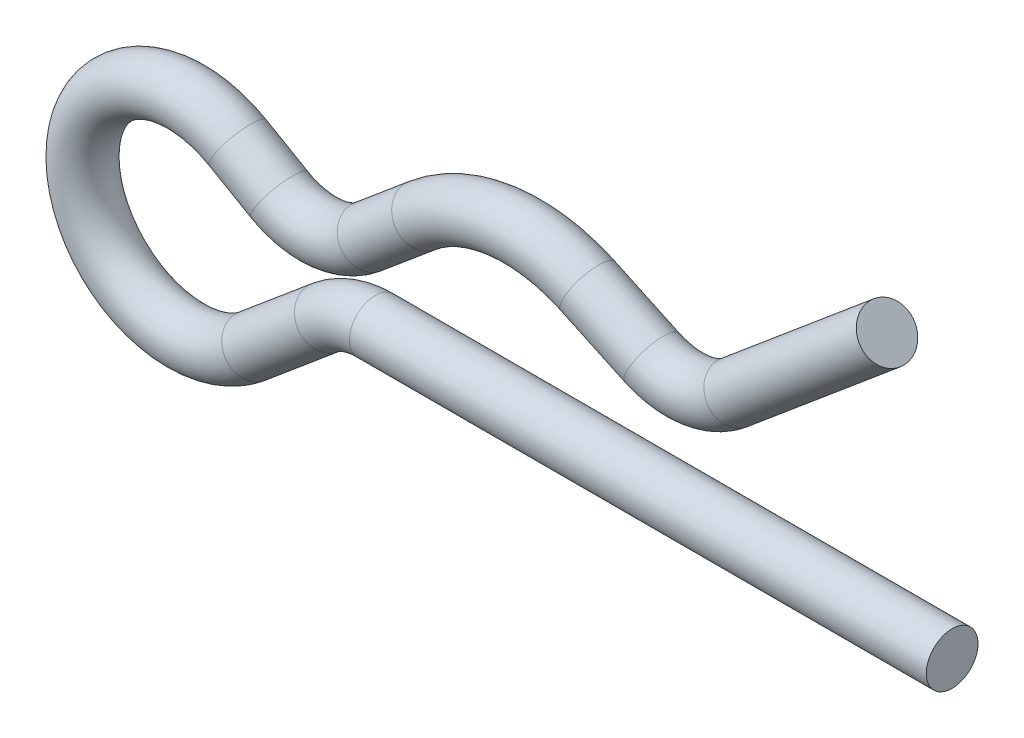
ISO-10303-21;
HEADER;
FILE_DESCRIPTION(('STEP AP214'),'2;1');
FILE_NAME('part.step','',(''),(''),'','','');
FILE_SCHEMA(('AUTOMOTIVE_DESIGN { 1 0 10303 214 1 1 1 1 }'));
ENDSEC;
DATA;
#1=APPLICATION_CONTEXT('core data for automotive mechanical design processes');
#2=APPLICATION_PROTOCOL_DEFINITION('international standard','automotive_design',2000,#1);
#3=PRODUCT_CONTEXT('',#1,'mechanical');
#4=PRODUCT('Part','Part','',(#3));
#5=PRODUCT_RELATED_PRODUCT_CATEGORY('part','',(#4));
#6=PRODUCT_DEFINITION_FORMATION('','',#4);
#7=PRODUCT_DEFINITION_CONTEXT('part definition',#1,'design');
#8=PRODUCT_DEFINITION('design','',#6,#7);
#9=PRODUCT_DEFINITION_SHAPE('','',#8);
#10=(LENGTH_UNIT() NAMED_UNIT(*) SI_UNIT(.MILLI.,.METRE.));
#11=(NAMED_UNIT(*) PLANE_ANGLE_UNIT() SI_UNIT($,.RADIAN.));
#12=(NAMED_UNIT(*) SI_UNIT($,.STERADIAN.) SOLID_ANGLE_UNIT());
#13=UNCERTAINTY_MEASURE_WITH_UNIT(LENGTH_MEASURE(1.E-05),#10,'distance_accuracy_value','');
#14=(GEOMETRIC_REPRESENTATION_CONTEXT(3) GLOBAL_UNCERTAINTY_ASSIGNED_CONTEXT((#13)) GLOBAL_UNIT_ASSIGNED_CONTEXT((#10,
#11,#12)) REPRESENTATION_CONTEXT('',''));
#15=CARTESIAN_POINT('',(0.,0.,0.));
#16=DIRECTION('',(0.,0.,1.));
#17=DIRECTION('',(1.,0.,0.));
#18=AXIS2_PLACEMENT_3D('',#15,#16,#17);
#19=CARTESIAN_POINT('',(10.7715398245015,8.33124333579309,0.));
#20=DIRECTION('',(-0.766044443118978,-0.642787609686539,0.));
#21=DIRECTION('',(-0.642787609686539,0.766044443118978,0.));
#22=AXIS2_PLACEMENT_3D('',#19,#20,#21);
#23=PLANE('',#22);
#24=CARTESIAN_POINT('',(11.2857699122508,7.71840778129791,0.));
#25=DIRECTION('',(0.766044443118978,0.642787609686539,0.));
#26=DIRECTION('',(-0.642787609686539,0.766044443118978,0.));
#27=AXIS2_PLACEMENT_3D('',#24,#25,#26);
#28=CIRCLE('',#27,0.8);
#29=CARTESIAN_POINT('',(11.8,7.10557222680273,0.));
#30=VERTEX_POINT('',#29);
#31=EDGE_CURVE('E11',#30,#30,#28,.T.);
#32=ORIENTED_EDGE('',*,*,#31,.T.);
#33=EDGE_LOOP('',(#32));
#34=FACE_BOUND('',#33,.T.);
#35=ADVANCED_FACE('F19',(#34),#23,.F.);
#36=CARTESIAN_POINT('',(13.3,0.,0.));
#37=DIRECTION('',(-1.,0.,0.));
#38=DIRECTION('',(0.,0.,1.));
#39=AXIS2_PLACEMENT_3D('',#36,#37,#38);
#40=PLANE('',#39);
#41=CARTESIAN_POINT('',(13.3,0.,0.));
#42=DIRECTION('',(-1.,0.,0.));
#43=DIRECTION('',(0.,0.,1.));
#44=AXIS2_PLACEMENT_3D('',#41,#42,#43);
#45=CIRCLE('',#44,0.8);
#46=CARTESIAN_POINT('',(13.3,0.,-0.8));
#47=VERTEX_POINT('',#46);
#48=EDGE_CURVE('E30',#47,#47,#45,.T.);
#49=ORIENTED_EDGE('',*,*,#48,.F.);
#50=EDGE_LOOP('',(#49));
#51=FACE_BOUND('',#50,.T.);
#52=ADVANCED_FACE('F144',(#51),#40,.F.);
#53=CARTESIAN_POINT('',(11.2857699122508,7.71840778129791,0.));
#54=DIRECTION('',(0.766044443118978,0.642787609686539,0.));
#55=DIRECTION('',(-0.642787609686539,0.766044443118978,0.));
#56=AXIS2_PLACEMENT_3D('',#53,#54,#55);
#57=CYLINDRICAL_SURFACE('',#56,0.8);
#58=ORIENTED_EDGE('',*,*,#31,.F.);
#59=EDGE_LOOP('',(#58));
#60=FACE_BOUND('',#59,.T.);
#61=CARTESIAN_POINT('',(6.57010290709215,3.76149333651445,0.));
#62=DIRECTION('',(0.766044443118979,0.642787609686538,0.));
#63=DIRECTION('',(-0.642787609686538,0.766044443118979,0.));
#64=AXIS2_PLACEMENT_3D('',#61,#62,#63);
#65=CIRCLE('',#64,0.8);
#66=CARTESIAN_POINT('',(6.05587281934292,4.37432889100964,0.));
#67=VERTEX_POINT('',#66);
#68=EDGE_CURVE('E85',#67,#67,#65,.T.);
#69=ORIENTED_EDGE('',*,*,#68,.T.);
#70=EDGE_LOOP('',(#69));
#71=FACE_BOUND('',#70,.T.);
#72=ADVANCED_FACE('F149',(#60,#71),#57,.T.);
#73=CARTESIAN_POINT('',(4.01312881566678,3.42486131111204,0.));
#74=DIRECTION('',(0.90630778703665,-0.4226182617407,0.));
#75=DIRECTION('',(0.4226182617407,0.90630778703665,0.));
#76=AXIS2_PLACEMENT_3D('',#73,#74,#75);
#77=CYLINDRICAL_SURFACE('',#76,0.8);
#78=CARTESIAN_POINT('',(4.01312881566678,3.42486131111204,0.));
#79=DIRECTION('',(0.90630778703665,-0.4226182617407,0.));
#80=DIRECTION('',(0.4226182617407,0.90630778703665,0.));
#81=AXIS2_PLACEMENT_3D('',#78,#79,#80);
#82=CIRCLE('',#81,0.8);
#83=CARTESIAN_POINT('',(4.35122342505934,4.14990754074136,0.));
#84=VERTEX_POINT('',#83);
#85=EDGE_CURVE('E80',#84,#84,#82,.T.);
#86=ORIENTED_EDGE('',*,*,#85,.F.);
#87=EDGE_LOOP('',(#86));
#88=FACE_BOUND('',#87,.T.);
#89=CARTESIAN_POINT('',(2.02856765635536,4.35027737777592,0.));
#90=DIRECTION('',(0.90630778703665,-0.422618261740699,0.));
#91=DIRECTION('',(0.,0.,-1.));
#92=AXIS2_PLACEMENT_3D('',#89,#90,#91);
#93=CIRCLE('',#92,0.8);
#94=CARTESIAN_POINT('',(1.6904730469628,3.6252311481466,0.));
#95=VERTEX_POINT('',#94);
#96=EDGE_CURVE('E100',#95,#95,#93,.T.);
#97=ORIENTED_EDGE('',*,*,#96,.T.);
#98=EDGE_LOOP('',(#97));
#99=FACE_BOUND('',#98,.T.);
#100=ADVANCED_FACE('F21',(#88,#99),#77,.T.);
#101=CARTESIAN_POINT('',(-3.08538052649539,3.6770133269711,0.));
#102=DIRECTION('',(0.766044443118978,0.642787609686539,0.));
#103=DIRECTION('',(-0.642787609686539,0.766044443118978,0.));
#104=AXIS2_PLACEMENT_3D('',#101,#102,#103);
#105=CYLINDRICAL_SURFACE('',#104,0.8);
#106=CARTESIAN_POINT('',(-3.08538052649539,3.67701332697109,0.));
#107=DIRECTION('',(0.766044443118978,0.642787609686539,0.));
#108=DIRECTION('',(0.,0.,-1.));
#109=AXIS2_PLACEMENT_3D('',#106,#107,#108);
#110=CIRCLE('',#109,0.8);
#111=CARTESIAN_POINT('',(-2.57115043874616,3.06417777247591,0.));
#112=VERTEX_POINT('',#111);
#113=EDGE_CURVE('E92',#112,#112,#110,.T.);
#114=ORIENTED_EDGE('',*,*,#113,.F.);
#115=EDGE_LOOP('',(#114));
#116=FACE_BOUND('',#115,.T.);
#117=CARTESIAN_POINT('',(-4.76678264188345,2.26614943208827,0.));
#118=DIRECTION('',(0.766044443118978,0.642787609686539,0.));
#119=DIRECTION('',(-0.642787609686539,0.766044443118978,0.));
#120=AXIS2_PLACEMENT_3D('',#117,#118,#119);
#121=CIRCLE('',#120,0.8);
#122=CARTESIAN_POINT('',(-5.28101272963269,2.87898498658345,0.));
#123=VERTEX_POINT('',#122);
#124=EDGE_CURVE('E98',#123,#123,#121,.T.);
#125=ORIENTED_EDGE('',*,*,#124,.T.);
#126=EDGE_LOOP('',(#125));
#127=FACE_BOUND('',#126,.T.);
#128=ADVANCED_FACE('F167',(#116,#127),#105,.T.);
#129=CARTESIAN_POINT('',(-7.50947290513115,2.02619512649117,0.));
#130=DIRECTION('',(0.866025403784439,-0.5,0.));
#131=DIRECTION('',(0.5,0.866025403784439,0.));
#132=AXIS2_PLACEMENT_3D('',#129,#130,#131);
#133=CYLINDRICAL_SURFACE('',#132,0.8);
#134=CARTESIAN_POINT('',(-7.50947290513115,2.02619512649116,0.));
#135=DIRECTION('',(-0.866025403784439,0.5,0.));
#136=DIRECTION('',(0.5,0.866025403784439,0.));
#137=AXIS2_PLACEMENT_3D('',#134,#135,#136);
#138=CIRCLE('',#137,0.8);
#139=CARTESIAN_POINT('',(-7.10947290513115,2.71901544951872,0.));
#140=VERTEX_POINT('',#139);
#141=EDGE_CURVE('E101',#140,#140,#138,.T.);
#142=ORIENTED_EDGE('',*,*,#141,.T.);
#143=EDGE_LOOP('',(#142));
#144=FACE_BOUND('',#143,.T.);
#145=CARTESIAN_POINT('',(-8.8,2.7712812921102,0.));
#146=DIRECTION('',(0.866025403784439,-0.5,0.));
#147=DIRECTION('',(0.5,0.866025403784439,0.));
#148=AXIS2_PLACEMENT_3D('',#145,#146,#147);
#149=CIRCLE('',#148,0.8);
#150=CARTESIAN_POINT('',(-9.2,2.07846096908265,0.));
#151=VERTEX_POINT('',#150);
#152=EDGE_CURVE('E23',#151,#151,#149,.T.);
#153=ORIENTED_EDGE('',*,*,#152,.T.);
#154=EDGE_LOOP('',(#153));
#155=FACE_BOUND('',#154,.T.);
#156=ADVANCED_FACE('F164',(#144,#155),#133,.T.);
#157=CARTESIAN_POINT('',(-8.34307964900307,-2.45134221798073,0.));
#158=DIRECTION('',(-0.766044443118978,-0.642787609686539,0.));
#159=DIRECTION('',(0.642787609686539,-0.766044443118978,0.));
#160=AXIS2_PLACEMENT_3D('',#157,#158,#159);
#161=CYLINDRICAL_SURFACE('',#160,0.8);
#162=CARTESIAN_POINT('',(-8.34307964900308,-2.45134221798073,0.));
#163=DIRECTION('',(0.766044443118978,0.642787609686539,0.));
#164=DIRECTION('',(0.642787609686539,-0.766044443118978,0.));
#165=AXIS2_PLACEMENT_3D('',#162,#163,#164);
#166=CIRCLE('',#165,0.8);
#167=CARTESIAN_POINT('',(-8.85730973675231,-1.83850666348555,0.));
#168=VERTEX_POINT('',#167);
#169=EDGE_CURVE('E113',#168,#168,#166,.T.);
#170=ORIENTED_EDGE('',*,*,#169,.T.);
#171=EDGE_LOOP('',(#170));
#172=FACE_BOUND('',#171,.T.);
#173=CARTESIAN_POINT('',(-6.09084545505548,-0.561493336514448,0.));
#174=DIRECTION('',(-0.766044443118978,-0.642787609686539,0.));
#175=DIRECTION('',(0.642787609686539,-0.766044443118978,0.));
#176=AXIS2_PLACEMENT_3D('',#173,#174,#175);
#177=CIRCLE('',#176,0.8);
#178=CARTESIAN_POINT('',(-5.57661536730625,-1.17432889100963,0.));
#179=VERTEX_POINT('',#178);
#180=EDGE_CURVE('E95',#179,#179,#177,.T.);
#181=ORIENTED_EDGE('',*,*,#180,.T.);
#182=EDGE_LOOP('',(#181));
#183=FACE_BOUND('',#182,.T.);
#184=ADVANCED_FACE('F166',(#172,#183),#161,.T.);
#185=CARTESIAN_POINT('',(-4.54815519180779,0.,0.));
#186=DIRECTION('',(-1.,0.,0.));
#187=DIRECTION('',(0.,0.,1.));
#188=AXIS2_PLACEMENT_3D('',#185,#186,#187);
#189=CYLINDRICAL_SURFACE('',#188,0.8);
#190=CARTESIAN_POINT('',(-4.54815519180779,0.,0.));
#191=DIRECTION('',(1.,0.,0.));
#192=DIRECTION('',(0.,-1.,0.));
#193=AXIS2_PLACEMENT_3D('',#190,#191,#192);
#194=CIRCLE('',#193,0.8);
#195=CARTESIAN_POINT('',(-4.54815519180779,0.,-0.8));
#196=VERTEX_POINT('',#195);
#197=EDGE_CURVE('E106',#196,#196,#194,.T.);
#198=ORIENTED_EDGE('',*,*,#197,.T.);
#199=EDGE_LOOP('',(#198));
#200=FACE_BOUND('',#199,.T.);
#201=ORIENTED_EDGE('',*,*,#48,.T.);
#202=EDGE_LOOP('',(#201));
#203=FACE_BOUND('',#202,.T.);
#204=ADVANCED_FACE('F141',(#200,#203),#189,.T.);
#205=CARTESIAN_POINT('',(5.02741264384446,5.6,0.));
#206=DIRECTION('',(0.,0.,1.));
#207=DIRECTION('',(1.,0.,0.));
#208=AXIS2_PLACEMENT_3D('',#205,#206,#207);
#209=TOROIDAL_SURFACE('',#208,2.4,0.8);
#210=ORIENTED_EDGE('',*,*,#85,.T.);
#211=EDGE_LOOP('',(#210));
#212=FACE_BOUND('',#211,.T.);
#213=ORIENTED_EDGE('',*,*,#68,.F.);
#214=EDGE_LOOP('',(#213));
#215=FACE_BOUND('',#214,.T.);
#216=ADVANCED_FACE('F81',(#212,#215),#209,.T.);
#217=CARTESIAN_POINT('',(0.,0.,0.));
#218=DIRECTION('',(0.,0.,-1.));
#219=DIRECTION('',(-1.,0.,0.));
#220=AXIS2_PLACEMENT_3D('',#217,#218,#219);
#221=TOROIDAL_SURFACE('',#220,4.8,0.8);
#222=ORIENTED_EDGE('',*,*,#113,.T.);
#223=EDGE_LOOP('',(#222));
#224=FACE_BOUND('',#223,.T.);
#225=ORIENTED_EDGE('',*,*,#96,.F.);
#226=EDGE_LOOP('',(#225));
#227=FACE_BOUND('',#226,.T.);
#228=ADVANCED_FACE('F128',(#224,#227),#221,.T.);
#229=CARTESIAN_POINT('',(-6.30947290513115,4.10465609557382,0.));
#230=DIRECTION('',(0.,0.,-1.));
#231=DIRECTION('',(-1.,0.,0.));
#232=AXIS2_PLACEMENT_3D('',#229,#230,#231);
#233=TOROIDAL_SURFACE('',#232,2.4,0.8);
#234=ORIENTED_EDGE('',*,*,#124,.F.);
#235=EDGE_LOOP('',(#234));
#236=FACE_BOUND('',#235,.T.);
#237=ORIENTED_EDGE('',*,*,#141,.F.);
#238=EDGE_LOOP('',(#237));
#239=FACE_BOUND('',#238,.T.);
#240=ADVANCED_FACE('F130',(#236,#239),#233,.T.);
#241=CARTESIAN_POINT('',(-10.4,0.,0.));
#242=DIRECTION('',(0.,0.,1.));
#243=DIRECTION('',(1.,0.,0.));
#244=AXIS2_PLACEMENT_3D('',#241,#242,#243);
#245=TOROIDAL_SURFACE('',#244,3.2,0.8);
#246=ORIENTED_EDGE('',*,*,#152,.F.);
#247=EDGE_LOOP('',(#246));
#248=FACE_BOUND('',#247,.T.);
#249=ORIENTED_EDGE('',*,*,#169,.F.);
#250=EDGE_LOOP('',(#249));
#251=FACE_BOUND('',#250,.T.);
#252=ADVANCED_FACE('F138',(#248,#251),#245,.T.);
#253=CARTESIAN_POINT('',(-4.54815519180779,-2.4,0.));
#254=DIRECTION('',(0.,0.,-1.));
#255=DIRECTION('',(-1.,0.,0.));
#256=AXIS2_PLACEMENT_3D('',#253,#254,#255);
#257=TOROIDAL_SURFACE('',#256,2.4,0.8);
#258=ORIENTED_EDGE('',*,*,#180,.F.);
#259=EDGE_LOOP('',(#258));
#260=FACE_BOUND('',#259,.T.);
#261=ORIENTED_EDGE('',*,*,#197,.F.);
#262=EDGE_LOOP('',(#261));
#263=FACE_BOUND('',#262,.T.);
#264=ADVANCED_FACE('F154',(#260,#263),#257,.T.);
#265=CLOSED_SHELL('',(#35,#52,#72,#100,#128,#156,#184,#204,#216,#228,#240,#252,#264));
#266=MANIFOLD_SOLID_BREP('B1',#265);
#267=ADVANCED_BREP_SHAPE_REPRESENTATION('',(#18,#266),#14);
#268=SHAPE_DEFINITION_REPRESENTATION(#9,#267);
ENDSEC;
END-ISO-10303-21;
